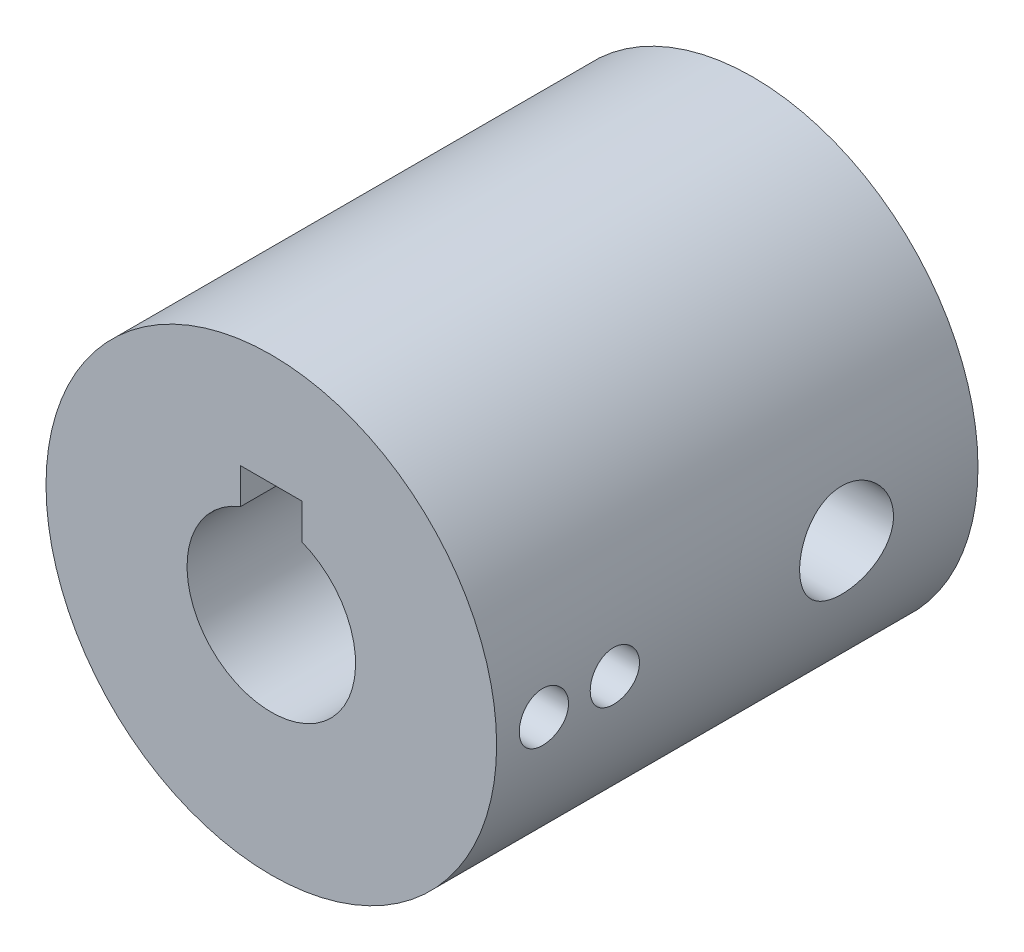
ISO-10303-21;
HEADER;
FILE_DESCRIPTION(('STEP AP214'),'2;1');
FILE_NAME('part.step','',(''),(''),'','','');
FILE_SCHEMA(('AUTOMOTIVE_DESIGN { 1 0 10303 214 1 1 1 1 }'));
ENDSEC;
DATA;
#1=APPLICATION_CONTEXT('core data for automotive mechanical design processes');
#2=APPLICATION_PROTOCOL_DEFINITION('international standard','automotive_design',2000,#1);
#3=PRODUCT_CONTEXT('',#1,'mechanical');
#4=PRODUCT('Part','Part','',(#3));
#5=PRODUCT_RELATED_PRODUCT_CATEGORY('part','',(#4));
#6=PRODUCT_DEFINITION_FORMATION('','',#4);
#7=PRODUCT_DEFINITION_CONTEXT('part definition',#1,'design');
#8=PRODUCT_DEFINITION('design','',#6,#7);
#9=PRODUCT_DEFINITION_SHAPE('','',#8);
#10=(LENGTH_UNIT() NAMED_UNIT(*) SI_UNIT(.MILLI.,.METRE.));
#11=(NAMED_UNIT(*) PLANE_ANGLE_UNIT() SI_UNIT($,.RADIAN.));
#12=(NAMED_UNIT(*) SI_UNIT($,.STERADIAN.) SOLID_ANGLE_UNIT());
#13=UNCERTAINTY_MEASURE_WITH_UNIT(LENGTH_MEASURE(1.E-05),#10,'distance_accuracy_value','');
#14=(GEOMETRIC_REPRESENTATION_CONTEXT(3) GLOBAL_UNCERTAINTY_ASSIGNED_CONTEXT((#13)) GLOBAL_UNIT_ASSIGNED_CONTEXT((#10,
#11,#12)) REPRESENTATION_CONTEXT('',''));
#15=CARTESIAN_POINT('',(0.,0.,0.));
#16=DIRECTION('',(0.,0.,1.));
#17=DIRECTION('',(1.,0.,0.));
#18=AXIS2_PLACEMENT_3D('',#15,#16,#17);
#19=CARTESIAN_POINT('',(0.,0.,28.));
#20=DIRECTION('',(0.,0.,-1.));
#21=DIRECTION('',(-1.,0.,0.));
#22=AXIS2_PLACEMENT_3D('',#19,#20,#21);
#23=CYLINDRICAL_SURFACE('',#22,19.05);
#24=CARTESIAN_POINT('',(0.,0.,0.));
#25=DIRECTION('',(0.,0.,1.));
#26=DIRECTION('',(1.,0.,0.));
#27=AXIS2_PLACEMENT_3D('',#24,#25,#26);
#28=CIRCLE('',#27,19.05);
#29=CARTESIAN_POINT('',(19.05,0.,0.));
#30=VERTEX_POINT('',#29);
#31=EDGE_CURVE('E11',#30,#30,#28,.T.);
#32=ORIENTED_EDGE('',*,*,#31,.T.);
#33=EDGE_LOOP('',(#32));
#34=FACE_BOUND('',#33,.T.);
#35=CARTESIAN_POINT('',(0.,0.,40.7));
#36=DIRECTION('',(0.,0.,1.));
#37=DIRECTION('',(1.,0.,0.));
#38=AXIS2_PLACEMENT_3D('',#35,#36,#37);
#39=CIRCLE('',#38,19.05);
#40=CARTESIAN_POINT('',(19.05,0.,40.7));
#41=VERTEX_POINT('',#40);
#42=EDGE_CURVE('E61',#41,#41,#39,.T.);
#43=ORIENTED_EDGE('',*,*,#42,.F.);
#44=EDGE_LOOP('',(#43));
#45=FACE_BOUND('',#44,.T.);
#46=CARTESIAN_POINT('',(19.05,0.,32.7866991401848));
#47=CARTESIAN_POINT('',(19.0499985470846,-0.116629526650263,32.7866941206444));
#48=CARTESIAN_POINT('',(19.0489175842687,-0.233334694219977,32.7768708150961));
#49=CARTESIAN_POINT('',(19.0447093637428,-0.463505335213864,32.737834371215));
#50=CARTESIAN_POINT('',(19.0415798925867,-0.576967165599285,32.7086002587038));
#51=CARTESIAN_POINT('',(19.0336276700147,-0.797285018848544,32.6316070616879));
#52=CARTESIAN_POINT('',(19.0288059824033,-0.904145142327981,32.5838596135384));
#53=CARTESIAN_POINT('',(19.0180074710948,-1.10831256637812,32.4712187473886));
#54=CARTESIAN_POINT('',(19.0120308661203,-1.20562167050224,32.4063285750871));
#55=CARTESIAN_POINT('',(18.9995627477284,-1.38836197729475,32.2609477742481));
#56=CARTESIAN_POINT('',(18.9930693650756,-1.47374666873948,32.1803988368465));
#57=CARTESIAN_POINT('',(18.9803148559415,-1.62981432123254,32.006111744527));
#58=CARTESIAN_POINT('',(18.9740537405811,-1.7004965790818,31.9123729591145));
#59=CARTESIAN_POINT('',(18.9624538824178,-1.82532098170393,31.7140716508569));
#60=CARTESIAN_POINT('',(18.9571175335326,-1.87942046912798,31.6094821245));
#61=CARTESIAN_POINT('',(18.9479952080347,-1.96927126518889,31.3926349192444));
#62=CARTESIAN_POINT('',(18.9442091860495,-2.00502311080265,31.2803774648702));
#63=CARTESIAN_POINT('',(18.9386334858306,-2.05702453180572,31.0518587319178));
#64=CARTESIAN_POINT('',(18.9368358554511,-2.07335181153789,30.9356153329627));
#65=CARTESIAN_POINT('',(18.9354159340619,-2.08628091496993,30.7020253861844));
#66=CARTESIAN_POINT('',(18.935793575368,-2.08288335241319,30.5846788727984));
#67=CARTESIAN_POINT('',(18.9386742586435,-2.0565231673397,30.3527514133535));
#68=CARTESIAN_POINT('',(18.9411680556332,-2.03364564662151,30.2381606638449));
#69=CARTESIAN_POINT('',(18.9479856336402,-1.96910749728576,30.0144548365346));
#70=CARTESIAN_POINT('',(18.9523094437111,-1.92744657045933,29.9053398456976));
#71=CARTESIAN_POINT('',(18.9623104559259,-1.82643113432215,29.695415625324));
#72=CARTESIAN_POINT('',(18.967990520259,-1.76703913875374,29.5946245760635));
#73=CARTESIAN_POINT('',(18.9800617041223,-1.63227437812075,29.4044083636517));
#74=CARTESIAN_POINT('',(18.9864528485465,-1.55690105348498,29.3149835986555));
#75=CARTESIAN_POINT('',(18.9992672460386,-1.39183917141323,29.1495440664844));
#76=CARTESIAN_POINT('',(19.00569049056,-1.3020771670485,29.073602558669));
#77=CARTESIAN_POINT('',(19.0178136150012,-1.11104022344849,28.9378539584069));
#78=CARTESIAN_POINT('',(19.0235134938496,-1.00976526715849,28.8780468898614));
#79=CARTESIAN_POINT('',(19.033550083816,-0.798524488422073,28.7762667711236));
#80=CARTESIAN_POINT('',(19.0378864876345,-0.688556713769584,28.7342977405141));
#81=CARTESIAN_POINT('',(19.0447045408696,-0.463077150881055,28.6694402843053));
#82=CARTESIAN_POINT('',(19.047186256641,-0.347565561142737,28.6465511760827));
#83=CARTESIAN_POINT('',(19.0500067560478,-0.114911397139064,28.6205969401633));
#84=CARTESIAN_POINT('',(19.0503564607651,0.00221977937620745,28.6174307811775));
#85=CARTESIAN_POINT('',(19.0489028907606,0.235344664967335,28.6307465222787));
#86=CARTESIAN_POINT('',(19.0470996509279,0.351338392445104,28.6472281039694));
#87=CARTESIAN_POINT('',(19.0415497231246,0.578601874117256,28.6992876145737));
#88=CARTESIAN_POINT('',(19.0378078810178,0.689882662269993,28.7348179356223));
#89=CARTESIAN_POINT('',(19.0288002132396,0.904905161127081,28.8239172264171));
#90=CARTESIAN_POINT('',(19.023534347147,1.00864667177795,28.8774866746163));
#91=CARTESIAN_POINT('',(19.0120397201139,1.20610063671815,29.0013920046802));
#92=CARTESIAN_POINT('',(19.005807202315,1.29977143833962,29.0717939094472));
#93=CARTESIAN_POINT('',(18.9930898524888,1.47400263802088,29.2272714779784));
#94=CARTESIAN_POINT('',(18.9866050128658,1.55456264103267,29.3123475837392));
#95=CARTESIAN_POINT('',(18.974080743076,1.7006389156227,29.4952008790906));
#96=CARTESIAN_POINT('',(18.9680433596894,1.76608864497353,29.5930313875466));
#97=CARTESIAN_POINT('',(18.9571296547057,1.87962827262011,29.7983549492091));
#98=CARTESIAN_POINT('',(18.9522533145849,1.92771844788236,29.9058478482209));
#99=CARTESIAN_POINT('',(18.9442270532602,2.00506373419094,30.127221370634));
#100=CARTESIAN_POINT('',(18.941073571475,2.03435771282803,30.2410882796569));
#101=CARTESIAN_POINT('',(18.9368393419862,2.07340485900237,30.4721611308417));
#102=CARTESIAN_POINT('',(18.9357585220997,2.08315870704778,30.5893669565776));
#103=CARTESIAN_POINT('',(18.9357937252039,2.0828382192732,30.8231290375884));
#104=CARTESIAN_POINT('',(18.9368981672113,2.07286841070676,30.9396854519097));
#105=CARTESIAN_POINT('',(18.9411546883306,2.03360354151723,31.1694564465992));
#106=CARTESIAN_POINT('',(18.9443067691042,2.00430846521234,31.2826710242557));
#107=CARTESIAN_POINT('',(18.9523000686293,1.92725486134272,31.5025392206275));
#108=CARTESIAN_POINT('',(18.9571409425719,1.87950010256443,31.6091941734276));
#109=CARTESIAN_POINT('',(18.9679670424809,1.76689323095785,31.8129923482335));
#110=CARTESIAN_POINT('',(18.9739522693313,1.70204110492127,31.9101355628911));
#111=CARTESIAN_POINT('',(18.9864307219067,1.55668919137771,32.092688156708));
#112=CARTESIAN_POINT('',(18.9929263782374,1.47611143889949,32.1780352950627));
#113=CARTESIAN_POINT('',(19.0056718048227,1.30175394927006,32.3340400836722));
#114=CARTESIAN_POINT('',(19.0119215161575,1.20797107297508,32.4046942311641));
#115=CARTESIAN_POINT('',(19.023490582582,1.00955604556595,32.5294773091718));
#116=CARTESIAN_POINT('',(19.0288071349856,0.904892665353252,32.5835568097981));
#117=CARTESIAN_POINT('',(19.0378813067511,0.687976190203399,32.6732992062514));
#118=CARTESIAN_POINT('',(19.0416406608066,0.575731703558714,32.708982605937));
#119=CARTESIAN_POINT('',(19.0462455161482,0.385725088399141,32.7521452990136));
#120=CARTESIAN_POINT('',(19.0476467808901,0.30917224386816,32.7650849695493));
#121=CARTESIAN_POINT('',(19.0495245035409,0.15509074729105,32.7823635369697));
#122=CARTESIAN_POINT('',(19.0500009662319,0.0775621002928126,32.7867024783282));
#123=CARTESIAN_POINT('',(19.05,0.,32.7866991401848));
#124=B_SPLINE_CURVE_WITH_KNOTS('',3,(#46,#47,#48,#49,#50,#51,#52,#53,#54,#55,#56,#57,#58,#59,
#60,#61,#62,#63,#64,#65,#66,#67,#68,#69,#70,#71,#72,#73,#74,#75,#76,#77,#78,#79,#80,#81,#82,#83,
#84,#85,#86,#87,#88,#89,#90,#91,#92,#93,#94,#95,#96,#97,#98,#99,#100,#101,#102,#103,#104,#105,
#106,#107,#108,#109,#110,#111,#112,#113,#114,#115,#116,#117,#118,#119,#120,#121,#122,#123),
.UNSPECIFIED.,.T.,.F.,(4,2,2,2,2,2,2,2,2,2,2,2,2,2,2,2,2,2,2,2,2,2,2,2,2,2,2,2,2,2,2,2,2,2,2,2,
2,2,4),(0.,0.349605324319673,0.699589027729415,1.04935310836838,1.39905101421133,
1.7500769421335,2.10111965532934,2.45305795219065,2.80498594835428,3.15550133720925,
3.50600581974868,3.85498686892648,4.2039734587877,4.55370314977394,4.90344508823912,
5.2550327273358,5.60662088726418,5.95828823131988,6.30994299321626,6.65979490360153,
7.00964114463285,7.35861707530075,7.70760226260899,8.05797942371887,8.40836714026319,
8.76026964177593,9.11216652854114,9.46333338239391,9.81448800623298,10.1637866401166,
10.5130855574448,10.8623131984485,11.2115411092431,11.5625465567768,11.9136355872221,
12.2657616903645,12.6174944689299,12.8499935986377,13.0824915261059),.UNSPECIFIED.);
#125=CARTESIAN_POINT('',(19.05,0.,32.7866991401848));
#126=VERTEX_POINT('',#125);
#127=EDGE_CURVE('E161',#126,#126,#124,.T.);
#128=ORIENTED_EDGE('',*,*,#127,.F.);
#129=EDGE_LOOP('',(#128));
#130=FACE_BOUND('',#129,.T.);
#131=CARTESIAN_POINT('',(19.05,0.,38.7866991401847));
#132=CARTESIAN_POINT('',(19.0499985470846,-0.116629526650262,38.7866941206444));
#133=CARTESIAN_POINT('',(19.0489175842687,-0.233334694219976,38.7768708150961));
#134=CARTESIAN_POINT('',(19.0447093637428,-0.463505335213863,38.737834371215));
#135=CARTESIAN_POINT('',(19.0415798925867,-0.576967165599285,38.7086002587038));
#136=CARTESIAN_POINT('',(19.0336276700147,-0.797285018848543,38.6316070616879));
#137=CARTESIAN_POINT('',(19.0288059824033,-0.904145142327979,38.5838596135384));
#138=CARTESIAN_POINT('',(19.0180074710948,-1.10831256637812,38.4712187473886));
#139=CARTESIAN_POINT('',(19.0120308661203,-1.20562167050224,38.4063285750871));
#140=CARTESIAN_POINT('',(18.9995627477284,-1.38836197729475,38.2609477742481));
#141=CARTESIAN_POINT('',(18.9930693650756,-1.47374666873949,38.1803988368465));
#142=CARTESIAN_POINT('',(18.9803148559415,-1.62981432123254,38.006111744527));
#143=CARTESIAN_POINT('',(18.9740537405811,-1.7004965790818,37.9123729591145));
#144=CARTESIAN_POINT('',(18.9624538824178,-1.82532098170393,37.7140716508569));
#145=CARTESIAN_POINT('',(18.9571175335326,-1.87942046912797,37.6094821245));
#146=CARTESIAN_POINT('',(18.9479952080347,-1.96927126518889,37.3926349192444));
#147=CARTESIAN_POINT('',(18.9442091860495,-2.00502311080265,37.2803774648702));
#148=CARTESIAN_POINT('',(18.9386334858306,-2.05702453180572,37.0518587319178));
#149=CARTESIAN_POINT('',(18.9368358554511,-2.07335181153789,36.9356153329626));
#150=CARTESIAN_POINT('',(18.9354159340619,-2.08628091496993,36.7020253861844));
#151=CARTESIAN_POINT('',(18.935793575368,-2.08288335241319,36.5846788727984));
#152=CARTESIAN_POINT('',(18.9386742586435,-2.0565231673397,36.3527514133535));
#153=CARTESIAN_POINT('',(18.9411680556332,-2.03364564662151,36.2381606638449));
#154=CARTESIAN_POINT('',(18.9479856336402,-1.96910749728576,36.0144548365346));
#155=CARTESIAN_POINT('',(18.9523094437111,-1.92744657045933,35.9053398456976));
#156=CARTESIAN_POINT('',(18.9623104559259,-1.82643113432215,35.695415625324));
#157=CARTESIAN_POINT('',(18.967990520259,-1.76703913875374,35.5946245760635));
#158=CARTESIAN_POINT('',(18.9800617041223,-1.63227437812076,35.4044083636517));
#159=CARTESIAN_POINT('',(18.9864528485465,-1.55690105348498,35.3149835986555));
#160=CARTESIAN_POINT('',(18.9992672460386,-1.39183917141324,35.1495440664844));
#161=CARTESIAN_POINT('',(19.00569049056,-1.3020771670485,35.073602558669));
#162=CARTESIAN_POINT('',(19.0178136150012,-1.11104022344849,34.9378539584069));
#163=CARTESIAN_POINT('',(19.0235134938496,-1.00976526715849,34.8780468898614));
#164=CARTESIAN_POINT('',(19.033550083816,-0.798524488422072,34.7762667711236));
#165=CARTESIAN_POINT('',(19.0378864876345,-0.688556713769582,34.7342977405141));
#166=CARTESIAN_POINT('',(19.0447045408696,-0.463077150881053,34.6694402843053));
#167=CARTESIAN_POINT('',(19.047186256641,-0.347565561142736,34.6465511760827));
#168=CARTESIAN_POINT('',(19.0500067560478,-0.114911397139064,34.6205969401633));
#169=CARTESIAN_POINT('',(19.0503564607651,0.00221977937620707,34.6174307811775));
#170=CARTESIAN_POINT('',(19.0489028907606,0.235344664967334,34.6307465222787));
#171=CARTESIAN_POINT('',(19.0470996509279,0.351338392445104,34.6472281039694));
#172=CARTESIAN_POINT('',(19.0415497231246,0.578601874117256,34.6992876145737));
#173=CARTESIAN_POINT('',(19.0378078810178,0.689882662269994,34.7348179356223));
#174=CARTESIAN_POINT('',(19.0288002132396,0.904905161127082,34.8239172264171));
#175=CARTESIAN_POINT('',(19.023534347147,1.00864667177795,34.8774866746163));
#176=CARTESIAN_POINT('',(19.0120397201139,1.20610063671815,35.0013920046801));
#177=CARTESIAN_POINT('',(19.005807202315,1.29977143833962,35.0717939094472));
#178=CARTESIAN_POINT('',(18.9930898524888,1.47400263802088,35.2272714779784));
#179=CARTESIAN_POINT('',(18.9866050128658,1.55456264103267,35.3123475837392));
#180=CARTESIAN_POINT('',(18.974080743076,1.7006389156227,35.4952008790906));
#181=CARTESIAN_POINT('',(18.9680433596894,1.76608864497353,35.5930313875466));
#182=CARTESIAN_POINT('',(18.9571296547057,1.87962827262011,35.7983549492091));
#183=CARTESIAN_POINT('',(18.9522533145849,1.92771844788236,35.9058478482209));
#184=CARTESIAN_POINT('',(18.9442270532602,2.00506373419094,36.127221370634));
#185=CARTESIAN_POINT('',(18.941073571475,2.03435771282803,36.2410882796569));
#186=CARTESIAN_POINT('',(18.9368393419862,2.07340485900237,36.4721611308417));
#187=CARTESIAN_POINT('',(18.9357585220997,2.08315870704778,36.5893669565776));
#188=CARTESIAN_POINT('',(18.9357937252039,2.0828382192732,36.8231290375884));
#189=CARTESIAN_POINT('',(18.9368981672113,2.07286841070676,36.9396854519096));
#190=CARTESIAN_POINT('',(18.9411546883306,2.03360354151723,37.1694564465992));
#191=CARTESIAN_POINT('',(18.9443067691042,2.00430846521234,37.2826710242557));
#192=CARTESIAN_POINT('',(18.9523000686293,1.92725486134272,37.5025392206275));
#193=CARTESIAN_POINT('',(18.9571409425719,1.87950010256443,37.6091941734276));
#194=CARTESIAN_POINT('',(18.9679670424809,1.76689323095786,37.8129923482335));
#195=CARTESIAN_POINT('',(18.9739522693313,1.70204110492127,37.9101355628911));
#196=CARTESIAN_POINT('',(18.9864307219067,1.55668919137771,38.092688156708));
#197=CARTESIAN_POINT('',(18.9929263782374,1.47611143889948,38.1780352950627));
#198=CARTESIAN_POINT('',(19.0056718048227,1.30175394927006,38.3340400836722));
#199=CARTESIAN_POINT('',(19.0119215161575,1.20797107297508,38.4046942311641));
#200=CARTESIAN_POINT('',(19.023490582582,1.00955604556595,38.5294773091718));
#201=CARTESIAN_POINT('',(19.0288071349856,0.904892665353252,38.5835568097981));
#202=CARTESIAN_POINT('',(19.0378813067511,0.687976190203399,38.6732992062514));
#203=CARTESIAN_POINT('',(19.0416406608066,0.575731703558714,38.708982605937));
#204=CARTESIAN_POINT('',(19.0462455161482,0.38572508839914,38.7521452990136));
#205=CARTESIAN_POINT('',(19.0476467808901,0.309172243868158,38.7650849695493));
#206=CARTESIAN_POINT('',(19.0495245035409,0.155090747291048,38.7823635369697));
#207=CARTESIAN_POINT('',(19.0500009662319,0.0775621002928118,38.7867024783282));
#208=CARTESIAN_POINT('',(19.05,0.,38.7866991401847));
#209=B_SPLINE_CURVE_WITH_KNOTS('',3,(#131,#132,#133,#134,#135,#136,#137,#138,#139,#140,#141,
#142,#143,#144,#145,#146,#147,#148,#149,#150,#151,#152,#153,#154,#155,#156,#157,#158,#159,#160,
#161,#162,#163,#164,#165,#166,#167,#168,#169,#170,#171,#172,#173,#174,#175,#176,#177,#178,#179,
#180,#181,#182,#183,#184,#185,#186,#187,#188,#189,#190,#191,#192,#193,#194,#195,#196,#197,#198,
#199,#200,#201,#202,#203,#204,#205,#206,#207,#208),.UNSPECIFIED.,.T.,.F.,(4,2,2,2,2,2,2,2,2,2,2,
2,2,2,2,2,2,2,2,2,2,2,2,2,2,2,2,2,2,2,2,2,2,2,2,2,2,2,4),(0.,0.349605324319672,
0.699589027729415,1.04935310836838,1.39905101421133,1.7500769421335,2.10111965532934,
2.45305795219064,2.80498594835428,3.15550133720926,3.50600581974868,3.85498686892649,
4.2039734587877,4.55370314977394,4.90344508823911,5.25503272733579,5.60662088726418,
5.95828823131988,6.30994299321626,6.65979490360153,7.00964114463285,7.35861707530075,
7.70760226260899,8.05797942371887,8.40836714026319,8.76026964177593,9.11216652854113,
9.46333338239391,9.81448800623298,10.1637866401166,10.5130855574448,10.8623131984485,
11.2115411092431,11.5625465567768,11.9136355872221,12.2657616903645,12.6174944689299,
12.8499935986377,13.0824915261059),.UNSPECIFIED.);
#210=CARTESIAN_POINT('',(19.05,0.,38.7866991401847));
#211=VERTEX_POINT('',#210);
#212=EDGE_CURVE('E186',#211,#211,#209,.T.);
#213=ORIENTED_EDGE('',*,*,#212,.F.);
#214=EDGE_LOOP('',(#213));
#215=FACE_BOUND('',#214,.T.);
#216=CARTESIAN_POINT('',(19.05,0.,15.08125));
#217=CARTESIAN_POINT('',(19.0499959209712,-0.220373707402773,15.0812421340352));
#218=CARTESIAN_POINT('',(19.0461369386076,-0.44084490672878,15.062832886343));
#219=CARTESIAN_POINT('',(19.0311151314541,-0.875542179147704,14.9897485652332));
#220=CARTESIAN_POINT('',(19.0199467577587,-1.08976337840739,14.9350459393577));
#221=CARTESIAN_POINT('',(18.9915517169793,-1.50561399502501,14.7911488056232));
#222=CARTESIAN_POINT('',(18.974331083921,-1.70725571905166,14.7019886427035));
#223=CARTESIAN_POINT('',(18.9356977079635,-2.09270704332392,14.4918124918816));
#224=CARTESIAN_POINT('',(18.9142851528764,-2.27651744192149,14.3707979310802));
#225=CARTESIAN_POINT('',(18.8692694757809,-2.62378927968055,14.0984721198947));
#226=CARTESIAN_POINT('',(18.8456413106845,-2.78695227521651,13.9467843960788));
#227=CARTESIAN_POINT('',(18.7990371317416,-3.08571194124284,13.6182269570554));
#228=CARTESIAN_POINT('',(18.7760611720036,-3.22130633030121,13.441355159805));
#229=CARTESIAN_POINT('',(18.7331173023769,-3.46237025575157,13.065277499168));
#230=CARTESIAN_POINT('',(18.7131815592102,-3.56752698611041,12.8658671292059));
#231=CARTESIAN_POINT('',(18.6789326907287,-3.74272553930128,12.4517230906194));
#232=CARTESIAN_POINT('',(18.6646189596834,-3.81277114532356,12.2369910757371));
#233=CARTESIAN_POINT('',(18.6434889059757,-3.91478262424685,11.8015218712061));
#234=CARTESIAN_POINT('',(18.6365691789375,-3.94727422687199,11.5809129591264));
#235=CARTESIAN_POINT('',(18.6306996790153,-3.9748891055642,11.1372750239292));
#236=CARTESIAN_POINT('',(18.6317490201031,-3.97001653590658,10.9142462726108));
#237=CARTESIAN_POINT('',(18.6416052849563,-3.92346557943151,10.4759727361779));
#238=CARTESIAN_POINT('',(18.6502844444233,-3.882393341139,10.2606602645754));
#239=CARTESIAN_POINT('',(18.6742208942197,-3.76556725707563,9.84005045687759));
#240=CARTESIAN_POINT('',(18.6894785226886,-3.68981162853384,9.63475363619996));
#241=CARTESIAN_POINT('',(18.7249813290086,-3.50520010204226,9.2382745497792));
#242=CARTESIAN_POINT('',(18.7452620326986,-3.39610708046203,9.04720600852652));
#243=CARTESIAN_POINT('',(18.7885035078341,-3.14808457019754,8.68586101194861));
#244=CARTESIAN_POINT('',(18.8114646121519,-3.00915137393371,8.51558714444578));
#245=CARTESIAN_POINT('',(18.8580309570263,-2.70216287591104,8.19717067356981));
#246=CARTESIAN_POINT('',(18.8816400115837,-2.53359105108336,8.04952616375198));
#247=CARTESIAN_POINT('',(18.9264317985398,-2.17381864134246,7.78452709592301));
#248=CARTESIAN_POINT('',(18.9476144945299,-1.98261771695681,7.66717299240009));
#249=CARTESIAN_POINT('',(18.9852259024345,-1.58243759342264,7.46598049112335));
#250=CARTESIAN_POINT('',(19.0016460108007,-1.37342709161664,7.3822026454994));
#251=CARTESIAN_POINT('',(19.0278174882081,-0.943878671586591,7.25109133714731));
#252=CARTESIAN_POINT('',(19.0375697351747,-0.723342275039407,7.2037530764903));
#253=CARTESIAN_POINT('',(19.0491832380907,-0.28127917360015,7.14757824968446));
#254=CARTESIAN_POINT('',(19.0511840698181,-0.0598425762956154,7.13806058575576));
#255=CARTESIAN_POINT('',(19.0474584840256,0.381456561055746,7.1559577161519));
#256=CARTESIAN_POINT('',(19.041732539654,0.601319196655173,7.18337024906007));
#257=CARTESIAN_POINT('',(19.023284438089,1.03100621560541,7.27378419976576));
#258=CARTESIAN_POINT('',(19.010631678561,1.2409080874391,7.33643276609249));
#259=CARTESIAN_POINT('',(18.9797444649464,1.64722634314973,7.49515220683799));
#260=CARTESIAN_POINT('',(18.9615095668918,1.84364165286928,7.59122573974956));
#261=CARTESIAN_POINT('',(18.9211344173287,2.22025942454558,7.81551770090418));
#262=CARTESIAN_POINT('',(18.8989460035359,2.40021497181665,7.9441418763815));
#263=CARTESIAN_POINT('',(18.8532315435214,2.73623229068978,8.22934461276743));
#264=CARTESIAN_POINT('',(18.8297053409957,2.89229126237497,8.38592644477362));
#265=CARTESIAN_POINT('',(18.7834912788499,3.17874220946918,8.72571145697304));
#266=CARTESIAN_POINT('',(18.760823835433,3.30866478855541,8.90931362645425));
#267=CARTESIAN_POINT('',(18.719342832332,3.53582983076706,9.29613420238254));
#268=CARTESIAN_POINT('',(18.7005291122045,3.63307365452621,9.49935179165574));
#269=CARTESIAN_POINT('',(18.6690539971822,3.79149757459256,9.91857679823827));
#270=CARTESIAN_POINT('',(18.6563594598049,3.85287233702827,10.1345080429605));
#271=CARTESIAN_POINT('',(18.6384941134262,3.93839822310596,10.5739137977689));
#272=CARTESIAN_POINT('',(18.6333222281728,3.96255467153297,10.7973872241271));
#273=CARTESIAN_POINT('',(18.6311510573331,3.97274816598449,11.2408125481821));
#274=CARTESIAN_POINT('',(18.6339925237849,3.95952797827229,11.4607469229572));
#275=CARTESIAN_POINT('',(18.6471702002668,3.89699199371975,11.8951819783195));
#276=CARTESIAN_POINT('',(18.65750633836,3.84767654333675,12.1096827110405));
#277=CARTESIAN_POINT('',(18.6844347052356,3.71469341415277,12.5266379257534));
#278=CARTESIAN_POINT('',(18.7010089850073,3.63112423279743,12.7291250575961));
#279=CARTESIAN_POINT('',(18.7385549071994,3.43209426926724,13.1173181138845));
#280=CARTESIAN_POINT('',(18.7595269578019,3.31663052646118,13.3030224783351));
#281=CARTESIAN_POINT('',(18.8039876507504,3.05458398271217,13.6560611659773));
#282=CARTESIAN_POINT('',(18.8275154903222,2.90746780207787,13.8229947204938));
#283=CARTESIAN_POINT('',(18.8741634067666,2.58738509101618,14.1300501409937));
#284=CARTESIAN_POINT('',(18.8972833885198,2.41441261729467,14.270165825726));
#285=CARTESIAN_POINT('',(18.9408258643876,2.04512680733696,14.5211437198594));
#286=CARTESIAN_POINT('',(18.9612141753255,1.84856730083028,14.631649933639));
#287=CARTESIAN_POINT('',(18.9966570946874,1.43929050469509,14.8178844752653));
#288=CARTESIAN_POINT('',(19.0117163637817,1.2265875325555,14.8936432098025));
#289=CARTESIAN_POINT('',(19.0319818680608,0.844598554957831,14.9940653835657));
#290=CARTESIAN_POINT('',(19.0386981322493,0.677442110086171,15.0266995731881));
#291=CARTESIAN_POINT('',(19.0477086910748,0.340209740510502,15.0702945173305));
#292=CARTESIAN_POINT('',(19.0500031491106,0.170133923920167,15.0812560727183));
#293=CARTESIAN_POINT('',(19.05,0.,15.08125));
#294=B_SPLINE_CURVE_WITH_KNOTS('',3,(#216,#217,#218,#219,#220,#221,#222,#223,#224,#225,#226,
#227,#228,#229,#230,#231,#232,#233,#234,#235,#236,#237,#238,#239,#240,#241,#242,#243,#244,#245,
#246,#247,#248,#249,#250,#251,#252,#253,#254,#255,#256,#257,#258,#259,#260,#261,#262,#263,#264,
#265,#266,#267,#268,#269,#270,#271,#272,#273,#274,#275,#276,#277,#278,#279,#280,#281,#282,#283,
#284,#285,#286,#287,#288,#289,#290,#291,#292,#293),.UNSPECIFIED.,.T.,.F.,(4,2,2,2,2,2,2,2,2,2,2,
2,2,2,2,2,2,2,2,2,2,2,2,2,2,2,2,2,2,2,2,2,2,2,2,2,2,2,4),(0.,0.660498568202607,1.32149913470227,
1.98184255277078,2.64215639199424,3.31112896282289,3.9801568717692,4.65583426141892,
5.33143883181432,5.99746626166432,6.66341964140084,7.31842936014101,7.97347275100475,
8.63328830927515,9.29318589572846,9.9659924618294,10.6388091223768,11.3128337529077,
11.9867696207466,12.6485122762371,13.3102144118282,13.9654053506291,14.6206484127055,
15.284500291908,15.9484298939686,16.6233876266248,17.2983172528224,17.9695490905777,
18.6406848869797,19.2985778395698,19.9564644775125,20.6124724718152,21.2685413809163,
21.9366790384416,22.6049705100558,23.280968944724,23.9563746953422,24.466314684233,
24.9762358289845),.UNSPECIFIED.);
#295=CARTESIAN_POINT('',(19.05,0.,15.08125));
#296=VERTEX_POINT('',#295);
#297=EDGE_CURVE('E125',#296,#296,#294,.T.);
#298=ORIENTED_EDGE('',*,*,#297,.F.);
#299=EDGE_LOOP('',(#298));
#300=FACE_BOUND('',#299,.T.);
#301=ADVANCED_FACE('F46',(#34,#45,#130,#215,#300),#23,.T.);
#302=CARTESIAN_POINT('',(0.,0.,40.7));
#303=DIRECTION('',(0.,0.,-1.));
#304=DIRECTION('',(-1.,0.,0.));
#305=AXIS2_PLACEMENT_3D('',#302,#303,#304);
#306=CYLINDRICAL_SURFACE('',#305,7.125);
#307=CARTESIAN_POINT('',(0.,0.,0.));
#308=DIRECTION('',(0.,0.,-1.));
#309=DIRECTION('',(-1.,0.,0.));
#310=AXIS2_PLACEMENT_3D('',#307,#308,#309);
#311=CIRCLE('',#310,7.125);
#312=CARTESIAN_POINT('',(2.6,6.63367356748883,0.));
#313=VERTEX_POINT('',#312);
#314=CARTESIAN_POINT('',(-2.6,6.63367356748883,0.));
#315=VERTEX_POINT('',#314);
#316=EDGE_CURVE('E69',#313,#315,#311,.T.);
#317=ORIENTED_EDGE('',*,*,#316,.T.);
#318=DIRECTION('',(0.,0.,-1.));
#319=VECTOR('',#318,1.);
#320=CARTESIAN_POINT('',(-2.6,6.63367356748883,40.7));
#321=LINE('',#320,#319);
#322=CARTESIAN_POINT('',(-2.6,6.63367356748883,40.7));
#323=VERTEX_POINT('',#322);
#324=EDGE_CURVE('E93',#323,#315,#321,.T.);
#325=ORIENTED_EDGE('',*,*,#324,.F.);
#326=CARTESIAN_POINT('',(0.,0.,40.7));
#327=DIRECTION('',(0.,0.,-1.));
#328=DIRECTION('',(-1.,0.,0.));
#329=AXIS2_PLACEMENT_3D('',#326,#327,#328);
#330=CIRCLE('',#329,7.125);
#331=CARTESIAN_POINT('',(2.6,6.63367356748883,40.7));
#332=VERTEX_POINT('',#331);
#333=EDGE_CURVE('E98',#332,#323,#330,.T.);
#334=ORIENTED_EDGE('',*,*,#333,.F.);
#335=DIRECTION('',(0.,0.,-1.));
#336=VECTOR('',#335,1.);
#337=CARTESIAN_POINT('',(2.6,6.63367356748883,40.7));
#338=LINE('',#337,#336);
#339=EDGE_CURVE('E143',#332,#313,#338,.T.);
#340=ORIENTED_EDGE('',*,*,#339,.T.);
#341=EDGE_LOOP('',(#317,#325,#334,#340));
#342=FACE_BOUND('',#341,.T.);
#343=CARTESIAN_POINT('',(7.125,0.,32.7866991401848));
#344=CARTESIAN_POINT('',(7.12499880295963,0.114404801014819,32.7866974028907));
#345=CARTESIAN_POINT('',(7.12221800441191,0.228827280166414,32.777242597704));
#346=CARTESIAN_POINT('',(7.11139610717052,0.454348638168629,32.739757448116));
#347=CARTESIAN_POINT('',(7.103353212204,0.565446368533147,32.711720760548));
#348=CARTESIAN_POINT('',(7.0828899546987,0.781032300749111,32.6380817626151));
#349=CARTESIAN_POINT('',(7.07047586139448,0.885529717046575,32.5925046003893));
#350=CARTESIAN_POINT('',(7.04256562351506,1.08539901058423,32.4851792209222));
#351=CARTESIAN_POINT('',(7.02706911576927,1.18076981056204,32.4234290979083));
#352=CARTESIAN_POINT('',(6.99417693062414,1.3622922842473,32.2837265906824));
#353=CARTESIAN_POINT('',(6.9767438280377,1.44815842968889,32.2054120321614));
#354=CARTESIAN_POINT('',(6.94217048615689,1.60574469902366,32.0355761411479));
#355=CARTESIAN_POINT('',(6.92503029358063,1.67746258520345,31.9440527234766));
#356=CARTESIAN_POINT('',(6.89259073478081,1.80619233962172,31.7480140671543));
#357=CARTESIAN_POINT('',(6.87733805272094,1.86286051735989,31.6432646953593));
#358=CARTESIAN_POINT('',(6.85095769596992,1.95766246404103,31.4252055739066));
#359=CARTESIAN_POINT('',(6.83982908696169,1.99580043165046,31.3118977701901));
#360=CARTESIAN_POINT('',(6.82334604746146,2.05143880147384,31.083134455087));
#361=CARTESIAN_POINT('',(6.8178452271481,2.0694635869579,30.9678173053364));
#362=CARTESIAN_POINT('',(6.81280462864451,2.0860008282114,30.7356747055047));
#363=CARTESIAN_POINT('',(6.81326348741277,2.08451774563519,30.6188496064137));
#364=CARTESIAN_POINT('',(6.81996035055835,2.06249427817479,30.3912294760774));
#365=CARTESIAN_POINT('',(6.82600079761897,2.0426053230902,30.2803646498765));
#366=CARTESIAN_POINT('',(6.84286141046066,1.98538499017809,30.063619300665));
#367=CARTESIAN_POINT('',(6.85368202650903,1.94805196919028,29.9577392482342));
#368=CARTESIAN_POINT('',(6.87904520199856,1.85651146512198,29.7523507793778));
#369=CARTESIAN_POINT('',(6.89363480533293,1.80208867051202,29.6529443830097));
#370=CARTESIAN_POINT('',(6.92486882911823,1.6780632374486,29.4644541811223));
#371=CARTESIAN_POINT('',(6.94151372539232,1.60845708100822,29.375372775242));
#372=CARTESIAN_POINT('',(6.97578917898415,1.45278259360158,29.2063596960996));
#373=CARTESIAN_POINT('',(6.99343268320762,1.36617206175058,29.1269292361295));
#374=CARTESIAN_POINT('',(7.02713237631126,1.18064073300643,28.9836068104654));
#375=CARTESIAN_POINT('',(7.04318847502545,1.08171923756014,28.9197157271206));
#376=CARTESIAN_POINT('',(7.07203860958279,0.873495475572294,28.8090018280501));
#377=CARTESIAN_POINT('',(7.08481219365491,0.764133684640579,28.7622852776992));
#378=CARTESIAN_POINT('',(7.1055107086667,0.538646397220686,28.6880534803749));
#379=CARTESIAN_POINT('',(7.11343692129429,0.422522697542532,28.6605331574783));
#380=CARTESIAN_POINT('',(7.12334700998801,0.191072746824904,28.6262980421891));
#381=CARTESIAN_POINT('',(7.12552496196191,0.0758552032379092,28.6189034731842));
#382=CARTESIAN_POINT('',(7.12425978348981,-0.154179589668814,28.623231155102));
#383=CARTESIAN_POINT('',(7.12081736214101,-0.268996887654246,28.6349509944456));
#384=CARTESIAN_POINT('',(7.10882492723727,-0.492439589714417,28.6766230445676));
#385=CARTESIAN_POINT('',(7.10038505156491,-0.601144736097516,28.7061823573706));
#386=CARTESIAN_POINT('',(7.07936917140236,-0.812032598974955,28.7822255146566));
#387=CARTESIAN_POINT('',(7.06679267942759,-0.914214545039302,28.8287113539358));
#388=CARTESIAN_POINT('',(7.03846217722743,-1.11169036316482,28.9384573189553));
#389=CARTESIAN_POINT('',(7.02264344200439,-1.20677928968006,29.0020690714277));
#390=CARTESIAN_POINT('',(6.98964822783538,-1.38516634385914,29.1438304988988));
#391=CARTESIAN_POINT('',(6.97247142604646,-1.46846165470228,29.2219836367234));
#392=CARTESIAN_POINT('',(6.93795817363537,-1.62386049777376,29.3937995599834));
#393=CARTESIAN_POINT('',(6.92063651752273,-1.69548112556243,29.4879029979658));
#394=CARTESIAN_POINT('',(6.88842679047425,-1.82194272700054,29.6871679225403));
#395=CARTESIAN_POINT('',(6.87353864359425,-1.8767842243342,29.7923290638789));
#396=CARTESIAN_POINT('',(6.84805483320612,-1.96774076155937,30.0103312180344));
#397=CARTESIAN_POINT('',(6.83743762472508,-2.0039500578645,30.1231302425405));
#398=CARTESIAN_POINT('',(6.82173901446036,-2.05676336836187,30.3535895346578));
#399=CARTESIAN_POINT('',(6.81665583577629,-2.07337367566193,30.4712482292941));
#400=CARTESIAN_POINT('',(6.81276970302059,-2.08610464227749,30.7030884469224));
#401=CARTESIAN_POINT('',(6.81372631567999,-2.08300969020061,30.8172234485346));
#402=CARTESIAN_POINT('',(6.82123751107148,-2.05827772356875,31.0432692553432));
#403=CARTESIAN_POINT('',(6.82779189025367,-2.03664138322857,31.1551801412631));
#404=CARTESIAN_POINT('',(6.84560297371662,-1.97593550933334,31.3723896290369));
#405=CARTESIAN_POINT('',(6.85680624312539,-1.93706374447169,31.4777482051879));
#406=CARTESIAN_POINT('',(6.88264539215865,-1.8431437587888,31.6805319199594));
#407=CARTESIAN_POINT('',(6.89728190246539,-1.78809256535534,31.7779555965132));
#408=CARTESIAN_POINT('',(6.92897408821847,-1.6611319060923,31.965769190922));
#409=CARTESIAN_POINT('',(6.94609621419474,-1.58870254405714,32.0557964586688));
#410=CARTESIAN_POINT('',(6.98049690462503,-1.42998990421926,32.2226733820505));
#411=CARTESIAN_POINT('',(6.99777550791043,-1.3437030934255,32.2995196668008));
#412=CARTESIAN_POINT('',(7.0311070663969,-1.15688874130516,32.4399359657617));
#413=CARTESIAN_POINT('',(7.0471137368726,-1.05603696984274,32.5030866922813));
#414=CARTESIAN_POINT('',(7.07555516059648,-0.844679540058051,32.6114442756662));
#415=CARTESIAN_POINT('',(7.08799173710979,-0.734178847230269,32.6566602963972));
#416=CARTESIAN_POINT('',(7.10667874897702,-0.520419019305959,32.7233623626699));
#417=CARTESIAN_POINT('',(7.1134940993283,-0.417892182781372,32.7470515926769));
#418=CARTESIAN_POINT('',(7.12265494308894,-0.210248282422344,32.7787196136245));
#419=CARTESIAN_POINT('',(7.12500110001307,-0.105131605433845,32.7867007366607));
#420=CARTESIAN_POINT('',(7.125,0.,32.7866991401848));
#421=B_SPLINE_CURVE_WITH_KNOTS('',3,(#343,#344,#345,#346,#347,#348,#349,#350,#351,#352,#353,
#354,#355,#356,#357,#358,#359,#360,#361,#362,#363,#364,#365,#366,#367,#368,#369,#370,#371,#372,
#373,#374,#375,#376,#377,#378,#379,#380,#381,#382,#383,#384,#385,#386,#387,#388,#389,#390,#391,
#392,#393,#394,#395,#396,#397,#398,#399,#400,#401,#402,#403,#404,#405,#406,#407,#408,#409,#410,
#411,#412,#413,#414,#415,#416,#417,#418,#419,#420),.UNSPECIFIED.,.T.,.F.,(4,2,2,2,2,2,2,2,2,2,2,
2,2,2,2,2,2,2,2,2,2,2,2,2,2,2,2,2,2,2,2,2,2,2,2,2,2,2,4),(0.,0.342828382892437,
0.685773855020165,1.02822945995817,1.37072543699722,1.72167199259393,2.07267401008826,
2.43111113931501,2.78946701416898,3.13824422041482,3.48694165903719,3.82375122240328,
4.16059251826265,4.50186048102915,4.84320759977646,5.19805499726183,5.55292253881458,
5.90995022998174,6.26688347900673,6.61160175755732,6.95627654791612,7.29362391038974,
7.63101104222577,7.97593744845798,8.32094609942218,8.67780956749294,9.03466189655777,
9.3896907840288,9.74460564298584,10.0854835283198,10.4263490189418,10.7634005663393,
11.100514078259,11.4493564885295,11.798287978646,12.1567367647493,12.5150021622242,
12.8300890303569,13.145129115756),.UNSPECIFIED.);
#422=CARTESIAN_POINT('',(7.125,0.,32.7866991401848));
#423=VERTEX_POINT('',#422);
#424=EDGE_CURVE('E154',#423,#423,#421,.T.);
#425=ORIENTED_EDGE('',*,*,#424,.F.);
#426=EDGE_LOOP('',(#425));
#427=FACE_BOUND('',#426,.T.);
#428=CARTESIAN_POINT('',(7.125,0.,38.7866991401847));
#429=CARTESIAN_POINT('',(7.12499880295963,0.114404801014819,38.7866974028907));
#430=CARTESIAN_POINT('',(7.12221800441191,0.228827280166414,38.777242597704));
#431=CARTESIAN_POINT('',(7.11139610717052,0.454348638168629,38.739757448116));
#432=CARTESIAN_POINT('',(7.103353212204,0.565446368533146,38.711720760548));
#433=CARTESIAN_POINT('',(7.0828899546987,0.781032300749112,38.6380817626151));
#434=CARTESIAN_POINT('',(7.07047586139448,0.885529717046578,38.5925046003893));
#435=CARTESIAN_POINT('',(7.04256562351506,1.08539901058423,38.4851792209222));
#436=CARTESIAN_POINT('',(7.02706911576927,1.18076981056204,38.4234290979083));
#437=CARTESIAN_POINT('',(6.99417693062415,1.3622922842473,38.2837265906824));
#438=CARTESIAN_POINT('',(6.9767438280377,1.44815842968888,38.2054120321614));
#439=CARTESIAN_POINT('',(6.94217048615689,1.60574469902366,38.0355761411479));
#440=CARTESIAN_POINT('',(6.92503029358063,1.67746258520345,37.9440527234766));
#441=CARTESIAN_POINT('',(6.89259073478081,1.80619233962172,37.7480140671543));
#442=CARTESIAN_POINT('',(6.87733805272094,1.86286051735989,37.6432646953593));
#443=CARTESIAN_POINT('',(6.85095769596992,1.95766246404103,37.4252055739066));
#444=CARTESIAN_POINT('',(6.83982908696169,1.99580043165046,37.3118977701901));
#445=CARTESIAN_POINT('',(6.82334604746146,2.05143880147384,37.083134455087));
#446=CARTESIAN_POINT('',(6.8178452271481,2.0694635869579,36.9678173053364));
#447=CARTESIAN_POINT('',(6.81280462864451,2.0860008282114,36.7356747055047));
#448=CARTESIAN_POINT('',(6.81326348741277,2.08451774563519,36.6188496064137));
#449=CARTESIAN_POINT('',(6.81996035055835,2.06249427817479,36.3912294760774));
#450=CARTESIAN_POINT('',(6.82600079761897,2.0426053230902,36.2803646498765));
#451=CARTESIAN_POINT('',(6.84286141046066,1.98538499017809,36.063619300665));
#452=CARTESIAN_POINT('',(6.85368202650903,1.94805196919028,35.9577392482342));
#453=CARTESIAN_POINT('',(6.87904520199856,1.85651146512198,35.7523507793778));
#454=CARTESIAN_POINT('',(6.89363480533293,1.80208867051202,35.6529443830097));
#455=CARTESIAN_POINT('',(6.92486882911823,1.6780632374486,35.4644541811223));
#456=CARTESIAN_POINT('',(6.94151372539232,1.60845708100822,35.375372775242));
#457=CARTESIAN_POINT('',(6.97578917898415,1.45278259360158,35.2063596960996));
#458=CARTESIAN_POINT('',(6.99343268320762,1.36617206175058,35.1269292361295));
#459=CARTESIAN_POINT('',(7.02713237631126,1.18064073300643,34.9836068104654));
#460=CARTESIAN_POINT('',(7.04318847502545,1.08171923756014,34.9197157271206));
#461=CARTESIAN_POINT('',(7.07203860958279,0.873495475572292,34.8090018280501));
#462=CARTESIAN_POINT('',(7.08481219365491,0.764133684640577,34.7622852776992));
#463=CARTESIAN_POINT('',(7.1055107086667,0.538646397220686,34.6880534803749));
#464=CARTESIAN_POINT('',(7.11343692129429,0.422522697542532,34.6605331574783));
#465=CARTESIAN_POINT('',(7.12334700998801,0.191072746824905,34.6262980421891));
#466=CARTESIAN_POINT('',(7.12552496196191,0.0758552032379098,34.6189034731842));
#467=CARTESIAN_POINT('',(7.12425978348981,-0.154179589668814,34.623231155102));
#468=CARTESIAN_POINT('',(7.12081736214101,-0.268996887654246,34.6349509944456));
#469=CARTESIAN_POINT('',(7.10882492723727,-0.492439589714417,34.6766230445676));
#470=CARTESIAN_POINT('',(7.10038505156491,-0.601144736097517,34.7061823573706));
#471=CARTESIAN_POINT('',(7.07936917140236,-0.812032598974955,34.7822255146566));
#472=CARTESIAN_POINT('',(7.06679267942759,-0.914214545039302,34.8287113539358));
#473=CARTESIAN_POINT('',(7.03846217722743,-1.11169036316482,34.9384573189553));
#474=CARTESIAN_POINT('',(7.02264344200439,-1.20677928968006,35.0020690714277));
#475=CARTESIAN_POINT('',(6.98964822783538,-1.38516634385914,35.1438304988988));
#476=CARTESIAN_POINT('',(6.97247142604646,-1.46846165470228,35.2219836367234));
#477=CARTESIAN_POINT('',(6.93795817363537,-1.62386049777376,35.3937995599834));
#478=CARTESIAN_POINT('',(6.92063651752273,-1.69548112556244,35.4879029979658));
#479=CARTESIAN_POINT('',(6.88842679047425,-1.82194272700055,35.6871679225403));
#480=CARTESIAN_POINT('',(6.87353864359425,-1.8767842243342,35.7923290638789));
#481=CARTESIAN_POINT('',(6.84805483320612,-1.96774076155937,36.0103312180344));
#482=CARTESIAN_POINT('',(6.83743762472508,-2.0039500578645,36.1231302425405));
#483=CARTESIAN_POINT('',(6.82173901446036,-2.05676336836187,36.3535895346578));
#484=CARTESIAN_POINT('',(6.81665583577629,-2.07337367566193,36.4712482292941));
#485=CARTESIAN_POINT('',(6.81276970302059,-2.08610464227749,36.7030884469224));
#486=CARTESIAN_POINT('',(6.81372631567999,-2.08300969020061,36.8172234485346));
#487=CARTESIAN_POINT('',(6.82123751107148,-2.05827772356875,37.0432692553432));
#488=CARTESIAN_POINT('',(6.82779189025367,-2.03664138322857,37.1551801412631));
#489=CARTESIAN_POINT('',(6.84560297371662,-1.97593550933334,37.3723896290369));
#490=CARTESIAN_POINT('',(6.85680624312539,-1.93706374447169,37.4777482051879));
#491=CARTESIAN_POINT('',(6.88264539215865,-1.8431437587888,37.6805319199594));
#492=CARTESIAN_POINT('',(6.89728190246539,-1.78809256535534,37.7779555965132));
#493=CARTESIAN_POINT('',(6.92897408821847,-1.6611319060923,37.965769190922));
#494=CARTESIAN_POINT('',(6.94609621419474,-1.58870254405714,38.0557964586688));
#495=CARTESIAN_POINT('',(6.98049690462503,-1.42998990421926,38.2226733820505));
#496=CARTESIAN_POINT('',(6.99777550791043,-1.3437030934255,38.2995196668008));
#497=CARTESIAN_POINT('',(7.0311070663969,-1.15688874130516,38.4399359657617));
#498=CARTESIAN_POINT('',(7.0471137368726,-1.05603696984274,38.5030866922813));
#499=CARTESIAN_POINT('',(7.07555516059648,-0.844679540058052,38.6114442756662));
#500=CARTESIAN_POINT('',(7.08799173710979,-0.73417884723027,38.6566602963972));
#501=CARTESIAN_POINT('',(7.10667874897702,-0.520419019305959,38.7233623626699));
#502=CARTESIAN_POINT('',(7.1134940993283,-0.417892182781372,38.7470515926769));
#503=CARTESIAN_POINT('',(7.12265494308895,-0.210248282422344,38.7787196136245));
#504=CARTESIAN_POINT('',(7.12500110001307,-0.105131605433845,38.7867007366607));
#505=CARTESIAN_POINT('',(7.125,0.,38.7866991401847));
#506=B_SPLINE_CURVE_WITH_KNOTS('',3,(#428,#429,#430,#431,#432,#433,#434,#435,#436,#437,#438,
#439,#440,#441,#442,#443,#444,#445,#446,#447,#448,#449,#450,#451,#452,#453,#454,#455,#456,#457,
#458,#459,#460,#461,#462,#463,#464,#465,#466,#467,#468,#469,#470,#471,#472,#473,#474,#475,#476,
#477,#478,#479,#480,#481,#482,#483,#484,#485,#486,#487,#488,#489,#490,#491,#492,#493,#494,#495,
#496,#497,#498,#499,#500,#501,#502,#503,#504,#505),.UNSPECIFIED.,.T.,.F.,(4,2,2,2,2,2,2,2,2,2,2,
2,2,2,2,2,2,2,2,2,2,2,2,2,2,2,2,2,2,2,2,2,2,2,2,2,2,2,4),(0.,0.342828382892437,
0.685773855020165,1.02822945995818,1.37072543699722,1.72167199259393,2.07267401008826,
2.43111113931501,2.78946701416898,3.13824422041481,3.48694165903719,3.82375122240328,
4.16059251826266,4.50186048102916,4.84320759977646,5.19805499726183,5.55292253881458,
5.90995022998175,6.26688347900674,6.61160175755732,6.95627654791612,7.29362391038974,
7.63101104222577,7.97593744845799,8.32094609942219,8.67780956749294,9.03466189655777,
9.3896907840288,9.74460564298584,10.0854835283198,10.4263490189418,10.7634005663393,
11.100514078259,11.4493564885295,11.798287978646,12.1567367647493,12.5150021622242,
12.8300890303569,13.145129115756),.UNSPECIFIED.);
#507=CARTESIAN_POINT('',(7.125,0.,38.7866991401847));
#508=VERTEX_POINT('',#507);
#509=EDGE_CURVE('E162',#508,#508,#506,.T.);
#510=ORIENTED_EDGE('',*,*,#509,.F.);
#511=EDGE_LOOP('',(#510));
#512=FACE_BOUND('',#511,.T.);
#513=CARTESIAN_POINT('',(7.125,0.,15.08125));
#514=CARTESIAN_POINT('',(7.12500028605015,0.102932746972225,15.0812503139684));
#515=CARTESIAN_POINT('',(7.12276461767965,0.205860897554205,15.0772410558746));
#516=CARTESIAN_POINT('',(7.11388021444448,0.410940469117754,15.0612576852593));
#517=CARTESIAN_POINT('',(7.10722992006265,0.513091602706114,15.0492807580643));
#518=CARTESIAN_POINT('',(7.0896848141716,0.715774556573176,15.0175171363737));
#519=CARTESIAN_POINT('',(7.07879118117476,0.816306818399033,14.9977326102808));
#520=CARTESIAN_POINT('',(7.05303558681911,1.01507850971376,14.9506043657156));
#521=CARTESIAN_POINT('',(7.0381719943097,1.1133169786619,14.9232575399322));
#522=CARTESIAN_POINT('',(6.98826858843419,1.40279089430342,14.8305645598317));
#523=CARTESIAN_POINT('',(6.94782624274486,1.58976464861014,14.7544088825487));
#524=CARTESIAN_POINT('',(6.85608629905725,1.94781907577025,14.5761810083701));
#525=CARTESIAN_POINT('',(6.80478607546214,2.1188958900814,14.474102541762));
#526=CARTESIAN_POINT('',(6.69161598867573,2.45382416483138,14.2389114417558));
#527=CARTESIAN_POINT('',(6.62925840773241,2.61633877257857,14.1041304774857));
#528=CARTESIAN_POINT('',(6.50225154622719,2.91773264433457,13.811032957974));
#529=CARTESIAN_POINT('',(6.43759999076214,3.0565876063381,13.6526925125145));
#530=CARTESIAN_POINT('',(6.30557926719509,3.3210360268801,13.2978005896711));
#531=CARTESIAN_POINT('',(6.23860567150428,3.44383163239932,13.0989988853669));
#532=CARTESIAN_POINT('',(6.11806849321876,3.65371042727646,12.6797038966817));
#533=CARTESIAN_POINT('',(6.06448566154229,3.74084499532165,12.459242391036));
#534=CARTESIAN_POINT('',(5.9886047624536,3.86085118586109,12.0506298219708));
#535=CARTESIAN_POINT('',(5.96208977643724,3.90129578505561,11.8654862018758));
#536=CARTESIAN_POINT('',(5.92639305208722,3.95532409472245,11.48974849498));
#537=CARTESIAN_POINT('',(5.91719409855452,3.96893448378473,11.2991600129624));
#538=CARTESIAN_POINT('',(5.91744396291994,3.9685614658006,10.9178172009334));
#539=CARTESIAN_POINT('',(5.92691363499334,3.95454720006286,10.727062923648));
#540=CARTESIAN_POINT('',(5.96315751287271,3.89966874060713,10.3511161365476));
#541=CARTESIAN_POINT('',(5.98994302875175,3.85878699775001,10.1659273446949));
#542=CARTESIAN_POINT('',(6.0573158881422,3.75212967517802,9.80566331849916));
#543=CARTESIAN_POINT('',(6.09790146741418,3.68635727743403,9.63058679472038));
#544=CARTESIAN_POINT('',(6.18848986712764,3.53216667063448,9.29338029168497));
#545=CARTESIAN_POINT('',(6.23849635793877,3.4437396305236,9.13125539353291));
#546=CARTESIAN_POINT('',(6.35154778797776,3.23110628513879,8.79826794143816));
#547=CARTESIAN_POINT('',(6.41541761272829,3.10349809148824,8.62985273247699));
#548=CARTESIAN_POINT('',(6.54356664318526,2.82332459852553,8.31531022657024));
#549=CARTESIAN_POINT('',(6.60784613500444,2.6707394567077,8.16920082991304));
#550=CARTESIAN_POINT('',(6.7374163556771,2.32593527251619,7.88833707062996));
#551=CARTESIAN_POINT('',(6.80213557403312,2.13125697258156,7.75628106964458));
#552=CARTESIAN_POINT('',(6.88894873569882,1.82196849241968,7.58470118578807));
#553=CARTESIAN_POINT('',(6.91618392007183,1.7159501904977,7.53191020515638));
#554=CARTESIAN_POINT('',(6.96646222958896,1.49880266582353,7.43573005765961));
#555=CARTESIAN_POINT('',(6.98950786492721,1.38767655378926,7.39233525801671));
#556=CARTESIAN_POINT('',(7.02924292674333,1.16911640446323,7.31822626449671));
#557=CARTESIAN_POINT('',(7.04626523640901,1.06197176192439,7.28683522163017));
#558=CARTESIAN_POINT('',(7.07558040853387,0.844851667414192,7.23310600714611));
#559=CARTESIAN_POINT('',(7.08787576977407,0.734877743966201,7.21076305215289));
#560=CARTESIAN_POINT('',(7.107376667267,0.513043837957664,7.17544890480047));
#561=CARTESIAN_POINT('',(7.11458474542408,0.401184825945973,7.16247303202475));
#562=CARTESIAN_POINT('',(7.12369864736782,0.176557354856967,7.14608078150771));
#563=CARTESIAN_POINT('',(7.12560499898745,0.0637889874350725,7.1426634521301));
#564=CARTESIAN_POINT('',(7.12414788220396,-0.148685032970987,7.14528016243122));
#565=CARTESIAN_POINT('',(7.12136229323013,-0.248409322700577,7.15027775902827));
#566=CARTESIAN_POINT('',(7.11165790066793,-0.447030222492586,7.16774620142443));
#567=CARTESIAN_POINT('',(7.10473779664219,-0.545926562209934,7.18021939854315));
#568=CARTESIAN_POINT('',(7.08693025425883,-0.742117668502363,7.212485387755));
#569=CARTESIAN_POINT('',(7.07604431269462,-0.839413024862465,7.23227541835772));
#570=CARTESIAN_POINT('',(7.05056318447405,-1.03180599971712,7.27894174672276));
#571=CARTESIAN_POINT('',(7.03596656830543,-1.12690275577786,7.30582077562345));
#572=CARTESIAN_POINT('',(6.98722877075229,-1.4071134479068,7.39640728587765));
#573=CARTESIAN_POINT('',(6.94803925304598,-1.58819637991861,7.47024018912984));
#574=CARTESIAN_POINT('',(6.85942561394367,-1.93549685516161,7.64227133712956));
#575=CARTESIAN_POINT('',(6.80999877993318,-2.10171044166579,7.74047604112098));
#576=CARTESIAN_POINT('',(6.69918264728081,-2.43313282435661,7.96996409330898));
#577=CARTESIAN_POINT('',(6.63708518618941,-2.596466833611,8.10361557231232));
#578=CARTESIAN_POINT('',(6.51036007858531,-2.89963934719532,8.39454208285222));
#579=CARTESIAN_POINT('',(6.44572969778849,-3.03945154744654,8.551843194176));
#580=CARTESIAN_POINT('',(6.31348892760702,-3.30602260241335,8.90458024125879));
#581=CARTESIAN_POINT('',(6.24624412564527,-3.4300070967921,9.10226765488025));
#582=CARTESIAN_POINT('',(6.12477643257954,-3.642499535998,9.51946207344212));
#583=CARTESIAN_POINT('',(6.07053524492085,-3.73105744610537,9.73893779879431));
#584=CARTESIAN_POINT('',(5.99303832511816,-3.85399176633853,10.1465333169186));
#585=CARTESIAN_POINT('',(5.96567638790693,-3.89582289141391,10.3316228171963));
#586=CARTESIAN_POINT('',(5.92822284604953,-3.95259484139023,10.7075249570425));
#587=CARTESIAN_POINT('',(5.91811377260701,-3.96756286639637,10.8983316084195));
#588=CARTESIAN_POINT('',(5.91661190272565,-3.96980245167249,11.2804284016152));
#589=CARTESIAN_POINT('',(5.92524362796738,-3.95703772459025,11.4717188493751));
#590=CARTESIAN_POINT('',(5.96000264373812,-3.90447746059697,11.84894775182));
#591=CARTESIAN_POINT('',(5.98614111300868,-3.86466465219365,12.0348827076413));
#592=CARTESIAN_POINT('',(6.05232012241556,-3.76016004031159,12.3960082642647));
#593=CARTESIAN_POINT('',(6.09230126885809,-3.69557440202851,12.5712410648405));
#594=CARTESIAN_POINT('',(6.18184472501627,-3.54375154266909,12.908918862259));
#595=CARTESIAN_POINT('',(6.23141071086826,-3.45650562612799,13.0713589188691));
#596=CARTESIAN_POINT('',(6.34362334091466,-3.24657471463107,13.4049212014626));
#597=CARTESIAN_POINT('',(6.40711484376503,-3.12052691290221,13.5736470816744));
#598=CARTESIAN_POINT('',(6.53476957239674,-2.8435428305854,13.8890793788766));
#599=CARTESIAN_POINT('',(6.5989333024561,-2.69258639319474,14.0357677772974));
#600=CARTESIAN_POINT('',(6.72878802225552,-2.35069123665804,14.3186470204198));
#601=CARTESIAN_POINT('',(6.79392092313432,-2.15721118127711,14.452080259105));
#602=CARTESIAN_POINT('',(6.88158127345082,-1.84957407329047,14.6259001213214));
#603=CARTESIAN_POINT('',(6.90913637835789,-1.74408419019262,14.6794663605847));
#604=CARTESIAN_POINT('',(6.96012539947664,-1.52793014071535,14.7772573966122));
#605=CARTESIAN_POINT('',(6.98356179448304,-1.41726913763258,14.82148781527));
#606=CARTESIAN_POINT('',(7.02387779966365,-1.20078769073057,14.8968277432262));
#607=CARTESIAN_POINT('',(7.04113586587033,-1.09530656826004,14.9287122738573));
#608=CARTESIAN_POINT('',(7.07108476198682,-0.881491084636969,14.9836915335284));
#609=CARTESIAN_POINT('',(7.0837779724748,-0.773158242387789,15.0067908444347));
#610=CARTESIAN_POINT('',(7.10423590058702,-0.554532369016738,15.0438812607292));
#611=CARTESIAN_POINT('',(7.1120028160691,-0.444240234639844,15.0578764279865));
#612=CARTESIAN_POINT('',(7.1223845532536,-0.222630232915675,15.0765603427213));
#613=CARTESIAN_POINT('',(7.12499969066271,-0.111312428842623,15.0812496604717));
#614=CARTESIAN_POINT('',(7.125,0.,15.08125));
#615=B_SPLINE_CURVE_WITH_KNOTS('',3,(#513,#514,#515,#516,#517,#518,#519,#520,#521,#522,#523,
#524,#525,#526,#527,#528,#529,#530,#531,#532,#533,#534,#535,#536,#537,#538,#539,#540,#541,#542,
#543,#544,#545,#546,#547,#548,#549,#550,#551,#552,#553,#554,#555,#556,#557,#558,#559,#560,#561,
#562,#563,#564,#565,#566,#567,#568,#569,#570,#571,#572,#573,#574,#575,#576,#577,#578,#579,#580,
#581,#582,#583,#584,#585,#586,#587,#588,#589,#590,#591,#592,#593,#594,#595,#596,#597,#598,#599,
#600,#601,#602,#603,#604,#605,#606,#607,#608,#609,#610,#611,#612,#613,#614),.UNSPECIFIED.,.T.,
.F.,(4,2,2,2,2,2,2,2,2,2,2,2,2,2,2,2,2,2,2,2,2,2,2,2,2,2,2,2,2,2,2,2,2,2,2,2,2,2,2,2,2,2,2,2,2,
2,2,2,2,2,4),(0.,0.308688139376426,0.617485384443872,0.92619692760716,1.23503550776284,
1.84976166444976,2.4646366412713,3.12241071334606,3.78085639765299,4.5064719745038,
5.23103840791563,5.80260469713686,6.37360244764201,6.94523840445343,7.51724811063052,
8.089184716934,8.66134461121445,9.32089116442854,9.98096424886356,10.7086853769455,
11.0728231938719,11.4367421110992,11.7750850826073,12.1132489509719,12.4512437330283,
12.7892048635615,13.0885059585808,13.3879012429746,13.687183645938,13.9865815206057,
14.582211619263,15.1779997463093,15.8352880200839,16.4933065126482,17.2182577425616,
17.9421828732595,18.5148464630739,19.0869298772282,19.6597622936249,20.2329608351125,
20.8037298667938,21.3747182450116,22.0319761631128,22.6897685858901,23.4172344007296,
23.781230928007,24.1450076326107,24.4791699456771,24.8131577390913,25.1469964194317,
25.4808146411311),.UNSPECIFIED.);
#616=CARTESIAN_POINT('',(7.125,0.,15.08125));
#617=VERTEX_POINT('',#616);
#618=EDGE_CURVE('E50',#617,#617,#615,.T.);
#619=ORIENTED_EDGE('',*,*,#618,.F.);
#620=EDGE_LOOP('',(#619));
#621=FACE_BOUND('',#620,.T.);
#622=ADVANCED_FACE('F95',(#342,#427,#512,#621),#306,.F.);
#623=CARTESIAN_POINT('',(0.,0.,0.));
#624=DIRECTION('',(0.,0.,1.));
#625=DIRECTION('',(1.,0.,0.));
#626=AXIS2_PLACEMENT_3D('',#623,#624,#625);
#627=PLANE('',#626);
#628=DIRECTION('',(0.,1.,0.));
#629=VECTOR('',#628,1.);
#630=CARTESIAN_POINT('',(-2.6,6.63367356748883,0.));
#631=LINE('',#630,#629);
#632=CARTESIAN_POINT('',(-2.6,9.63367356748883,0.));
#633=VERTEX_POINT('',#632);
#634=EDGE_CURVE('E137',#315,#633,#631,.T.);
#635=ORIENTED_EDGE('',*,*,#634,.F.);
#636=ORIENTED_EDGE('',*,*,#316,.F.);
#637=DIRECTION('',(0.,-1.,0.));
#638=VECTOR('',#637,1.);
#639=CARTESIAN_POINT('',(2.6,6.63367356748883,0.));
#640=LINE('',#639,#638);
#641=CARTESIAN_POINT('',(2.6,9.63367356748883,0.));
#642=VERTEX_POINT('',#641);
#643=EDGE_CURVE('E117',#642,#313,#640,.T.);
#644=ORIENTED_EDGE('',*,*,#643,.F.);
#645=DIRECTION('',(1.,0.,0.));
#646=VECTOR('',#645,1.);
#647=CARTESIAN_POINT('',(2.6,9.63367356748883,0.));
#648=LINE('',#647,#646);
#649=EDGE_CURVE('E122',#633,#642,#648,.T.);
#650=ORIENTED_EDGE('',*,*,#649,.F.);
#651=EDGE_LOOP('',(#635,#636,#644,#650));
#652=FACE_BOUND('',#651,.T.);
#653=ORIENTED_EDGE('',*,*,#31,.F.);
#654=EDGE_LOOP('',(#653));
#655=FACE_BOUND('',#654,.T.);
#656=ADVANCED_FACE('F205',(#652,#655),#627,.F.);
#657=CARTESIAN_POINT('',(0.,0.,40.7));
#658=DIRECTION('',(0.,0.,1.));
#659=DIRECTION('',(1.,0.,0.));
#660=AXIS2_PLACEMENT_3D('',#657,#658,#659);
#661=PLANE('',#660);
#662=ORIENTED_EDGE('',*,*,#333,.T.);
#663=DIRECTION('',(0.,1.,0.));
#664=VECTOR('',#663,1.);
#665=CARTESIAN_POINT('',(-2.6,6.63367356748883,40.7));
#666=LINE('',#665,#664);
#667=CARTESIAN_POINT('',(-2.6,9.63367356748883,40.7));
#668=VERTEX_POINT('',#667);
#669=EDGE_CURVE('E108',#323,#668,#666,.T.);
#670=ORIENTED_EDGE('',*,*,#669,.T.);
#671=DIRECTION('',(1.,0.,0.));
#672=VECTOR('',#671,1.);
#673=CARTESIAN_POINT('',(2.6,9.63367356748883,40.7));
#674=LINE('',#673,#672);
#675=CARTESIAN_POINT('',(2.6,9.63367356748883,40.7));
#676=VERTEX_POINT('',#675);
#677=EDGE_CURVE('E77',#668,#676,#674,.T.);
#678=ORIENTED_EDGE('',*,*,#677,.T.);
#679=DIRECTION('',(0.,-1.,0.));
#680=VECTOR('',#679,1.);
#681=CARTESIAN_POINT('',(2.6,6.63367356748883,40.7));
#682=LINE('',#681,#680);
#683=EDGE_CURVE('E105',#676,#332,#682,.T.);
#684=ORIENTED_EDGE('',*,*,#683,.T.);
#685=EDGE_LOOP('',(#662,#670,#678,#684));
#686=FACE_BOUND('',#685,.T.);
#687=ORIENTED_EDGE('',*,*,#42,.T.);
#688=EDGE_LOOP('',(#687));
#689=FACE_BOUND('',#688,.T.);
#690=ADVANCED_FACE('F113',(#686,#689),#661,.T.);
#691=CARTESIAN_POINT('',(2.6,6.63367356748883,40.7));
#692=DIRECTION('',(1.,0.,0.));
#693=DIRECTION('',(0.,0.,-1.));
#694=AXIS2_PLACEMENT_3D('',#691,#692,#693);
#695=PLANE('',#694);
#696=ORIENTED_EDGE('',*,*,#643,.T.);
#697=ORIENTED_EDGE('',*,*,#339,.F.);
#698=ORIENTED_EDGE('',*,*,#683,.F.);
#699=DIRECTION('',(0.,0.,-1.));
#700=VECTOR('',#699,1.);
#701=CARTESIAN_POINT('',(2.6,9.63367356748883,40.7));
#702=LINE('',#701,#700);
#703=EDGE_CURVE('E146',#676,#642,#702,.T.);
#704=ORIENTED_EDGE('',*,*,#703,.T.);
#705=EDGE_LOOP('',(#696,#697,#698,#704));
#706=FACE_BOUND('',#705,.T.);
#707=ADVANCED_FACE('F177',(#706),#695,.F.);
#708=CARTESIAN_POINT('',(2.6,9.63367356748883,40.7));
#709=DIRECTION('',(0.,1.,0.));
#710=DIRECTION('',(0.,0.,1.));
#711=AXIS2_PLACEMENT_3D('',#708,#709,#710);
#712=PLANE('',#711);
#713=ORIENTED_EDGE('',*,*,#649,.T.);
#714=ORIENTED_EDGE('',*,*,#703,.F.);
#715=ORIENTED_EDGE('',*,*,#677,.F.);
#716=DIRECTION('',(0.,0.,-1.));
#717=VECTOR('',#716,1.);
#718=CARTESIAN_POINT('',(-2.6,9.63367356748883,40.7));
#719=LINE('',#718,#717);
#720=EDGE_CURVE('E104',#668,#633,#719,.T.);
#721=ORIENTED_EDGE('',*,*,#720,.T.);
#722=EDGE_LOOP('',(#713,#714,#715,#721));
#723=FACE_BOUND('',#722,.T.);
#724=ADVANCED_FACE('F238',(#723),#712,.F.);
#725=CARTESIAN_POINT('',(-2.6,6.63367356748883,40.7));
#726=DIRECTION('',(-1.,0.,0.));
#727=DIRECTION('',(0.,-1.,0.));
#728=AXIS2_PLACEMENT_3D('',#725,#726,#727);
#729=PLANE('',#728);
#730=ORIENTED_EDGE('',*,*,#634,.T.);
#731=ORIENTED_EDGE('',*,*,#720,.F.);
#732=ORIENTED_EDGE('',*,*,#669,.F.);
#733=ORIENTED_EDGE('',*,*,#324,.T.);
#734=EDGE_LOOP('',(#730,#731,#732,#733));
#735=FACE_BOUND('',#734,.T.);
#736=ADVANCED_FACE('F109',(#735),#729,.F.);
#737=CARTESIAN_POINT('',(28.194,0.,30.7036991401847));
#738=DIRECTION('',(-1.,0.,0.));
#739=DIRECTION('',(0.,0.,1.));
#740=AXIS2_PLACEMENT_3D('',#737,#738,#739);
#741=CYLINDRICAL_SURFACE('',#740,2.083);
#742=ORIENTED_EDGE('',*,*,#424,.T.);
#743=EDGE_LOOP('',(#742));
#744=FACE_BOUND('',#743,.T.);
#745=ORIENTED_EDGE('',*,*,#127,.T.);
#746=EDGE_LOOP('',(#745));
#747=FACE_BOUND('',#746,.T.);
#748=ADVANCED_FACE('F170',(#744,#747),#741,.F.);
#749=CARTESIAN_POINT('',(28.194,0.,36.7036991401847));
#750=DIRECTION('',(-1.,0.,0.));
#751=DIRECTION('',(0.,0.,1.));
#752=AXIS2_PLACEMENT_3D('',#749,#750,#751);
#753=CYLINDRICAL_SURFACE('',#752,2.083);
#754=ORIENTED_EDGE('',*,*,#509,.T.);
#755=EDGE_LOOP('',(#754));
#756=FACE_BOUND('',#755,.T.);
#757=ORIENTED_EDGE('',*,*,#212,.T.);
#758=EDGE_LOOP('',(#757));
#759=FACE_BOUND('',#758,.T.);
#760=ADVANCED_FACE('F174',(#756,#759),#753,.F.);
#761=CARTESIAN_POINT('',(28.194,0.,11.1125));
#762=DIRECTION('',(-1.,0.,0.));
#763=DIRECTION('',(0.,0.,1.));
#764=AXIS2_PLACEMENT_3D('',#761,#762,#763);
#765=CYLINDRICAL_SURFACE('',#764,3.96875);
#766=ORIENTED_EDGE('',*,*,#618,.T.);
#767=EDGE_LOOP('',(#766));
#768=FACE_BOUND('',#767,.T.);
#769=ORIENTED_EDGE('',*,*,#297,.T.);
#770=EDGE_LOOP('',(#769));
#771=FACE_BOUND('',#770,.T.);
#772=ADVANCED_FACE('F208',(#768,#771),#765,.F.);
#773=CLOSED_SHELL('',(#301,#622,#656,#690,#707,#724,#736,#748,#760,#772));
#774=MANIFOLD_SOLID_BREP('B2',#773);
#775=ADVANCED_BREP_SHAPE_REPRESENTATION('',(#18,#774),#14);
#776=SHAPE_DEFINITION_REPRESENTATION(#9,#775);
ENDSEC;
END-ISO-10303-21;
